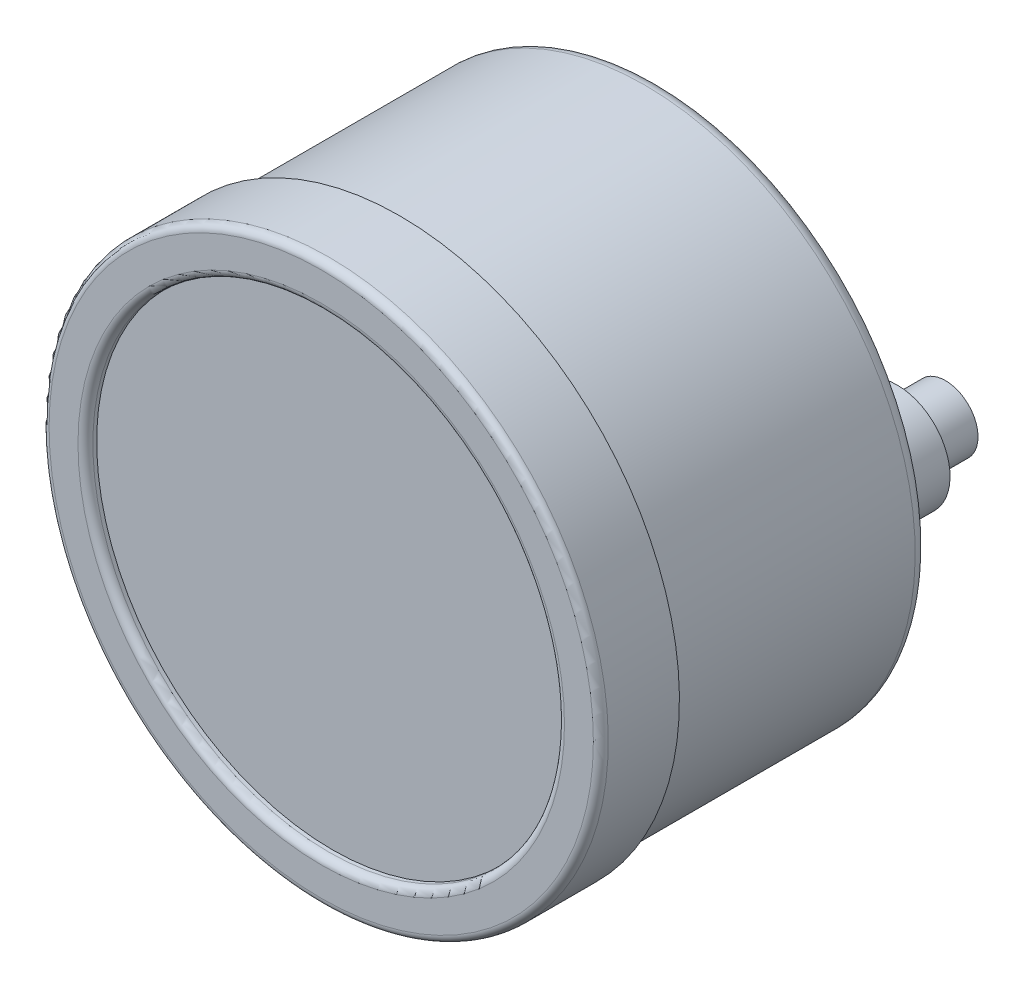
ISO-10303-21;
HEADER;
FILE_DESCRIPTION(('STEP AP214'),'2;1');
FILE_NAME('part.step','',(''),(''),'','','');
FILE_SCHEMA(('AUTOMOTIVE_DESIGN { 1 0 10303 214 1 1 1 1 }'));
ENDSEC;
DATA;
#1=APPLICATION_CONTEXT('core data for automotive mechanical design processes');
#2=APPLICATION_PROTOCOL_DEFINITION('international standard','automotive_design',2000,#1);
#3=PRODUCT_CONTEXT('',#1,'mechanical');
#4=PRODUCT('Part','Part','',(#3));
#5=PRODUCT_RELATED_PRODUCT_CATEGORY('part','',(#4));
#6=PRODUCT_DEFINITION_FORMATION('','',#4);
#7=PRODUCT_DEFINITION_CONTEXT('part definition',#1,'design');
#8=PRODUCT_DEFINITION('design','',#6,#7);
#9=PRODUCT_DEFINITION_SHAPE('','',#8);
#10=(LENGTH_UNIT() NAMED_UNIT(*) SI_UNIT(.MILLI.,.METRE.));
#11=(NAMED_UNIT(*) PLANE_ANGLE_UNIT() SI_UNIT($,.RADIAN.));
#12=(NAMED_UNIT(*) SI_UNIT($,.STERADIAN.) SOLID_ANGLE_UNIT());
#13=UNCERTAINTY_MEASURE_WITH_UNIT(LENGTH_MEASURE(1.E-05),#10,'distance_accuracy_value','');
#14=(GEOMETRIC_REPRESENTATION_CONTEXT(3) GLOBAL_UNCERTAINTY_ASSIGNED_CONTEXT((#13)) GLOBAL_UNIT_ASSIGNED_CONTEXT((#10,
#11,#12)) REPRESENTATION_CONTEXT('',''));
#15=CARTESIAN_POINT('',(0.,0.,0.));
#16=DIRECTION('',(0.,0.,1.));
#17=DIRECTION('',(1.,0.,0.));
#18=AXIS2_PLACEMENT_3D('',#15,#16,#17);
#19=CARTESIAN_POINT('',(14.055,0.,-29.3));
#20=DIRECTION('',(0.,0.,-1.));
#21=DIRECTION('',(0.,-1.,0.));
#22=AXIS2_PLACEMENT_3D('',#19,#20,#21);
#23=PLANE('',#22);
#24=CARTESIAN_POINT('',(15.,0.,-29.3));
#25=DIRECTION('',(0.,0.,1.));
#26=DIRECTION('',(0.,1.,0.));
#27=AXIS2_PLACEMENT_3D('',#24,#25,#26);
#28=CIRCLE('',#27,1.89);
#29=CARTESIAN_POINT('',(15.,1.89,-29.3));
#30=VERTEX_POINT('',#29);
#31=EDGE_CURVE('E179',#30,#30,#28,.F.);
#32=ORIENTED_EDGE('',*,*,#31,.T.);
#33=EDGE_LOOP('',(#32));
#34=FACE_BOUND('',#33,.T.);
#35=ADVANCED_FACE('F14',(#34),#23,.T.);
#36=CARTESIAN_POINT('',(15.,0.,-31.45));
#37=DIRECTION('',(0.,0.,1.));
#38=DIRECTION('',(0.,1.,0.));
#39=AXIS2_PLACEMENT_3D('',#36,#37,#38);
#40=CYLINDRICAL_SURFACE('',#39,1.89);
#41=ORIENTED_EDGE('',*,*,#31,.F.);
#42=EDGE_LOOP('',(#41));
#43=FACE_BOUND('',#42,.T.);
#44=CARTESIAN_POINT('',(15.,0.,-33.6));
#45=DIRECTION('',(0.,0.,1.));
#46=DIRECTION('',(0.,1.,0.));
#47=AXIS2_PLACEMENT_3D('',#44,#45,#46);
#48=CIRCLE('',#47,1.89);
#49=CARTESIAN_POINT('',(15.,1.89,-33.6));
#50=VERTEX_POINT('',#49);
#51=EDGE_CURVE('E176',#50,#50,#48,.T.);
#52=ORIENTED_EDGE('',*,*,#51,.F.);
#53=EDGE_LOOP('',(#52));
#54=FACE_BOUND('',#53,.T.);
#55=ADVANCED_FACE('F301',(#43,#54),#40,.F.);
#56=CARTESIAN_POINT('',(12.61,0.,-33.6));
#57=DIRECTION('',(0.,0.,-1.));
#58=DIRECTION('',(0.,-1.,0.));
#59=AXIS2_PLACEMENT_3D('',#56,#57,#58);
#60=PLANE('',#59);
#61=CARTESIAN_POINT('',(15.,0.,-33.6));
#62=DIRECTION('',(0.,0.,1.));
#63=DIRECTION('',(0.,1.,0.));
#64=AXIS2_PLACEMENT_3D('',#61,#62,#63);
#65=CIRCLE('',#64,2.89);
#66=CARTESIAN_POINT('',(15.,2.89,-33.6));
#67=VERTEX_POINT('',#66);
#68=EDGE_CURVE('E173',#67,#67,#65,.T.);
#69=ORIENTED_EDGE('',*,*,#68,.F.);
#70=EDGE_LOOP('',(#69));
#71=FACE_BOUND('',#70,.T.);
#72=ORIENTED_EDGE('',*,*,#51,.T.);
#73=EDGE_LOOP('',(#72));
#74=FACE_BOUND('',#73,.T.);
#75=ADVANCED_FACE('F281',(#71,#74),#60,.T.);
#76=CARTESIAN_POINT('',(0.,0.,6.336));
#77=DIRECTION('',(0.,0.,-1.));
#78=DIRECTION('',(0.,-1.,0.));
#79=AXIS2_PLACEMENT_3D('',#76,#77,#78);
#80=TOROIDAL_SURFACE('',#79,21.664,0.664);
#81=CARTESIAN_POINT('',(0.,0.,6.336));
#82=DIRECTION('',(0.,0.,-1.));
#83=DIRECTION('',(0.,-1.,0.));
#84=AXIS2_PLACEMENT_3D('',#81,#82,#83);
#85=CIRCLE('',#84,21.);
#86=CARTESIAN_POINT('',(0.,-21.,6.336));
#87=VERTEX_POINT('',#86);
#88=EDGE_CURVE('E182',#87,#87,#85,.T.);
#89=ORIENTED_EDGE('',*,*,#88,.T.);
#90=EDGE_LOOP('',(#89));
#91=FACE_BOUND('',#90,.T.);
#92=CARTESIAN_POINT('',(0.,0.,7.));
#93=DIRECTION('',(0.,0.,1.));
#94=DIRECTION('',(0.,1.,0.));
#95=AXIS2_PLACEMENT_3D('',#92,#93,#94);
#96=CIRCLE('',#95,21.664);
#97=CARTESIAN_POINT('',(-21.664,0.,7.));
#98=VERTEX_POINT('',#97);
#99=CARTESIAN_POINT('',(0.,21.664,7.));
#100=VERTEX_POINT('',#99);
#101=EDGE_CURVE('E64',#98,#100,#96,.F.);
#102=ORIENTED_EDGE('',*,*,#101,.F.);
#103=CARTESIAN_POINT('',(0.,0.,7.));
#104=DIRECTION('',(0.,0.,1.));
#105=DIRECTION('',(-1.,0.,0.));
#106=AXIS2_PLACEMENT_3D('',#103,#104,#105);
#107=CIRCLE('',#106,21.664);
#108=CARTESIAN_POINT('',(0.,-21.664,7.));
#109=VERTEX_POINT('',#108);
#110=EDGE_CURVE('E61',#109,#98,#107,.F.);
#111=ORIENTED_EDGE('',*,*,#110,.F.);
#112=CARTESIAN_POINT('',(0.,0.,7.));
#113=DIRECTION('',(0.,0.,1.));
#114=DIRECTION('',(0.,-1.,0.));
#115=AXIS2_PLACEMENT_3D('',#112,#113,#114);
#116=CIRCLE('',#115,21.664);
#117=EDGE_CURVE('E58',#100,#109,#116,.F.);
#118=ORIENTED_EDGE('',*,*,#117,.F.);
#119=EDGE_LOOP('',(#102,#111,#118));
#120=FACE_BOUND('',#119,.T.);
#121=ADVANCED_FACE('F63',(#91,#120),#80,.T.);
#122=CARTESIAN_POINT('',(15.,0.,-31.45));
#123=DIRECTION('',(0.,0.,1.));
#124=DIRECTION('',(0.,1.,0.));
#125=AXIS2_PLACEMENT_3D('',#122,#123,#124);
#126=CYLINDRICAL_SURFACE('',#125,2.89);
#127=ORIENTED_EDGE('',*,*,#68,.T.);
#128=EDGE_LOOP('',(#127));
#129=FACE_BOUND('',#128,.T.);
#130=CARTESIAN_POINT('',(15.,0.,-29.3));
#131=DIRECTION('',(0.,0.,1.));
#132=DIRECTION('',(0.,1.,0.));
#133=AXIS2_PLACEMENT_3D('',#130,#131,#132);
#134=CIRCLE('',#133,2.89);
#135=CARTESIAN_POINT('',(15.,2.89,-29.3));
#136=VERTEX_POINT('',#135);
#137=EDGE_CURVE('E68',#136,#136,#134,.T.);
#138=ORIENTED_EDGE('',*,*,#137,.F.);
#139=EDGE_LOOP('',(#138));
#140=FACE_BOUND('',#139,.T.);
#141=ADVANCED_FACE('F93',(#129,#140),#126,.T.);
#142=CARTESIAN_POINT('',(-22.95,0.,7.));
#143=DIRECTION('',(0.,0.,1.));
#144=DIRECTION('',(0.,1.,0.));
#145=AXIS2_PLACEMENT_3D('',#142,#143,#144);
#146=PLANE('',#145);
#147=ORIENTED_EDGE('',*,*,#117,.T.);
#148=ORIENTED_EDGE('',*,*,#110,.T.);
#149=ORIENTED_EDGE('',*,*,#101,.T.);
#150=EDGE_LOOP('',(#147,#148,#149));
#151=FACE_BOUND('',#150,.T.);
#152=CARTESIAN_POINT('',(0.,0.,7.));
#153=DIRECTION('',(0.,0.,-1.));
#154=DIRECTION('',(0.,-1.,0.));
#155=AXIS2_PLACEMENT_3D('',#152,#153,#154);
#156=CIRCLE('',#155,24.236);
#157=CARTESIAN_POINT('',(0.,-24.236,7.));
#158=VERTEX_POINT('',#157);
#159=CARTESIAN_POINT('',(-24.236,0.,7.));
#160=VERTEX_POINT('',#159);
#161=EDGE_CURVE('E122',#158,#160,#156,.T.);
#162=ORIENTED_EDGE('',*,*,#161,.F.);
#163=CARTESIAN_POINT('',(0.,0.,7.));
#164=DIRECTION('',(0.,0.,-1.));
#165=DIRECTION('',(0.,1.,0.));
#166=AXIS2_PLACEMENT_3D('',#163,#164,#165);
#167=CIRCLE('',#166,24.236);
#168=CARTESIAN_POINT('',(0.,24.236,7.));
#169=VERTEX_POINT('',#168);
#170=EDGE_CURVE('E118',#169,#158,#167,.T.);
#171=ORIENTED_EDGE('',*,*,#170,.F.);
#172=CARTESIAN_POINT('',(0.,0.,7.));
#173=DIRECTION('',(0.,0.,-1.));
#174=DIRECTION('',(-1.,0.,0.));
#175=AXIS2_PLACEMENT_3D('',#172,#173,#174);
#176=CIRCLE('',#175,24.236);
#177=EDGE_CURVE('E120',#160,#169,#176,.T.);
#178=ORIENTED_EDGE('',*,*,#177,.F.);
#179=EDGE_LOOP('',(#162,#171,#178));
#180=FACE_BOUND('',#179,.T.);
#181=ADVANCED_FACE('F72',(#151,#180),#146,.T.);
#182=CARTESIAN_POINT('',(11.205,0.,-29.3));
#183=DIRECTION('',(0.,0.,-1.));
#184=DIRECTION('',(1.,0.,0.));
#185=AXIS2_PLACEMENT_3D('',#182,#183,#184);
#186=PLANE('',#185);
#187=CARTESIAN_POINT('',(15.,0.,-29.3));
#188=DIRECTION('',(0.,0.,1.));
#189=DIRECTION('',(0.,1.,0.));
#190=AXIS2_PLACEMENT_3D('',#187,#188,#189);
#191=CIRCLE('',#190,4.7);
#192=CARTESIAN_POINT('',(15.,4.7,-29.3));
#193=VERTEX_POINT('',#192);
#194=EDGE_CURVE('E129',#193,#193,#191,.T.);
#195=ORIENTED_EDGE('',*,*,#194,.F.);
#196=EDGE_LOOP('',(#195));
#197=FACE_BOUND('',#196,.T.);
#198=ORIENTED_EDGE('',*,*,#137,.T.);
#199=EDGE_LOOP('',(#198));
#200=FACE_BOUND('',#199,.T.);
#201=ADVANCED_FACE('F92',(#197,#200),#186,.T.);
#202=CARTESIAN_POINT('',(-1.60666666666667,0.,-21.4666666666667));
#203=DIRECTION('',(0.,0.,-1.));
#204=DIRECTION('',(0.,-1.,0.));
#205=AXIS2_PLACEMENT_3D('',#202,#203,#204);
#206=PLANE('',#205);
#207=CARTESIAN_POINT('',(0.,0.,-21.4666666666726));
#208=DIRECTION('',(0.,0.,-1.));
#209=DIRECTION('',(0.,-1.,0.));
#210=AXIS2_PLACEMENT_3D('',#207,#208,#209);
#211=CIRCLE('',#210,3.21333333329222);
#212=CARTESIAN_POINT('',(0.,-3.21333333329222,-21.4666666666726));
#213=VERTEX_POINT('',#212);
#214=EDGE_CURVE('E157',#213,#213,#211,.T.);
#215=ORIENTED_EDGE('',*,*,#214,.T.);
#216=EDGE_LOOP('',(#215));
#217=FACE_BOUND('',#216,.T.);
#218=ADVANCED_FACE('F147',(#217),#206,.T.);
#219=CARTESIAN_POINT('',(0.,0.,6.336));
#220=DIRECTION('',(0.,0.,-1.));
#221=DIRECTION('',(0.,-1.,0.));
#222=AXIS2_PLACEMENT_3D('',#219,#220,#221);
#223=TOROIDAL_SURFACE('',#222,24.236,0.664);
#224=ORIENTED_EDGE('',*,*,#170,.T.);
#225=ORIENTED_EDGE('',*,*,#161,.T.);
#226=ORIENTED_EDGE('',*,*,#177,.T.);
#227=EDGE_LOOP('',(#224,#225,#226));
#228=FACE_BOUND('',#227,.T.);
#229=CARTESIAN_POINT('',(0.,0.,6.336));
#230=DIRECTION('',(0.,0.,1.));
#231=DIRECTION('',(0.,1.,0.));
#232=AXIS2_PLACEMENT_3D('',#229,#230,#231);
#233=CIRCLE('',#232,24.9);
#234=CARTESIAN_POINT('',(0.,24.9,6.336));
#235=VERTEX_POINT('',#234);
#236=EDGE_CURVE('E154',#235,#235,#233,.F.);
#237=ORIENTED_EDGE('',*,*,#236,.F.);
#238=EDGE_LOOP('',(#237));
#239=FACE_BOUND('',#238,.T.);
#240=ADVANCED_FACE('F126',(#228,#239),#223,.T.);
#241=CARTESIAN_POINT('',(15.,0.,-23.95));
#242=DIRECTION('',(0.,0.,1.));
#243=DIRECTION('',(0.,1.,0.));
#244=AXIS2_PLACEMENT_3D('',#241,#242,#243);
#245=CYLINDRICAL_SURFACE('',#244,4.7);
#246=ORIENTED_EDGE('',*,*,#194,.T.);
#247=EDGE_LOOP('',(#246));
#248=FACE_BOUND('',#247,.T.);
#249=CARTESIAN_POINT('',(15.,0.,-22.9999999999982));
#250=DIRECTION('',(0.,0.,1.));
#251=DIRECTION('',(0.,1.,0.));
#252=AXIS2_PLACEMENT_3D('',#249,#250,#251);
#253=CIRCLE('',#252,4.7);
#254=CARTESIAN_POINT('',(15.,4.7,-22.9999999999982));
#255=VERTEX_POINT('',#254);
#256=EDGE_CURVE('E156',#255,#255,#253,.T.);
#257=ORIENTED_EDGE('',*,*,#256,.F.);
#258=EDGE_LOOP('',(#257));
#259=FACE_BOUND('',#258,.T.);
#260=ADVANCED_FACE('F146',(#248,#259),#245,.T.);
#261=CARTESIAN_POINT('',(0.,0.,-23.0000000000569));
#262=DIRECTION('',(0.,0.,-1.));
#263=DIRECTION('',(0.,-1.,0.));
#264=AXIS2_PLACEMENT_3D('',#261,#262,#263);
#265=CONICAL_SURFACE('',#264,4.74666666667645,0.785398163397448);
#266=ORIENTED_EDGE('',*,*,#214,.F.);
#267=EDGE_LOOP('',(#266));
#268=FACE_BOUND('',#267,.T.);
#269=CARTESIAN_POINT('',(0.,0.,-23.0000000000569));
#270=DIRECTION('',(0.,0.,-1.));
#271=DIRECTION('',(0.,-1.,0.));
#272=AXIS2_PLACEMENT_3D('',#269,#270,#271);
#273=CIRCLE('',#272,4.74666666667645);
#274=CARTESIAN_POINT('',(0.,-4.74666666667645,-23.0000000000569));
#275=VERTEX_POINT('',#274);
#276=EDGE_CURVE('E161',#275,#275,#273,.F.);
#277=ORIENTED_EDGE('',*,*,#276,.F.);
#278=EDGE_LOOP('',(#277));
#279=FACE_BOUND('',#278,.T.);
#280=ADVANCED_FACE('F400',(#268,#279),#265,.F.);
#281=CARTESIAN_POINT('',(0.,0.,3.168));
#282=DIRECTION('',(0.,0.,1.));
#283=DIRECTION('',(0.,1.,0.));
#284=AXIS2_PLACEMENT_3D('',#281,#282,#283);
#285=CYLINDRICAL_SURFACE('',#284,24.9);
#286=CARTESIAN_POINT('',(0.,0.,0.));
#287=DIRECTION('',(0.,0.,1.));
#288=DIRECTION('',(0.,1.,0.));
#289=AXIS2_PLACEMENT_3D('',#286,#287,#288);
#290=CIRCLE('',#289,24.9);
#291=CARTESIAN_POINT('',(0.,24.9,0.));
#292=VERTEX_POINT('',#291);
#293=EDGE_CURVE('E262',#292,#292,#290,.F.);
#294=ORIENTED_EDGE('',*,*,#293,.F.);
#295=EDGE_LOOP('',(#294));
#296=FACE_BOUND('',#295,.T.);
#297=ORIENTED_EDGE('',*,*,#236,.T.);
#298=EDGE_LOOP('',(#297));
#299=FACE_BOUND('',#298,.T.);
#300=ADVANCED_FACE('F228',(#296,#299),#285,.T.);
#301=CARTESIAN_POINT('',(-13.8208333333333,0.,-23.));
#302=DIRECTION('',(0.,0.,-1.));
#303=DIRECTION('',(0.,-1.,0.));
#304=AXIS2_PLACEMENT_3D('',#301,#302,#303);
#305=PLANE('',#304);
#306=CARTESIAN_POINT('',(0.,0.,-23.));
#307=DIRECTION('',(0.,0.,1.));
#308=DIRECTION('',(0.,-1.,0.));
#309=AXIS2_PLACEMENT_3D('',#306,#307,#308);
#310=CIRCLE('',#309,22.895);
#311=CARTESIAN_POINT('',(0.,-22.895,-23.));
#312=VERTEX_POINT('',#311);
#313=CARTESIAN_POINT('',(0.,22.895,-23.));
#314=VERTEX_POINT('',#313);
#315=EDGE_CURVE('E185',#312,#314,#310,.T.);
#316=ORIENTED_EDGE('',*,*,#315,.F.);
#317=CARTESIAN_POINT('',(0.,0.,-23.));
#318=DIRECTION('',(0.,0.,1.));
#319=DIRECTION('',(-1.,0.,0.));
#320=AXIS2_PLACEMENT_3D('',#317,#318,#319);
#321=CIRCLE('',#320,22.895);
#322=CARTESIAN_POINT('',(-22.895,0.,-23.));
#323=VERTEX_POINT('',#322);
#324=EDGE_CURVE('E34',#323,#312,#321,.T.);
#325=ORIENTED_EDGE('',*,*,#324,.F.);
#326=CARTESIAN_POINT('',(0.,0.,-23.));
#327=DIRECTION('',(0.,0.,1.));
#328=DIRECTION('',(0.,1.,0.));
#329=AXIS2_PLACEMENT_3D('',#326,#327,#328);
#330=CIRCLE('',#329,22.895);
#331=EDGE_CURVE('E214',#314,#323,#330,.T.);
#332=ORIENTED_EDGE('',*,*,#331,.F.);
#333=EDGE_LOOP('',(#316,#325,#332));
#334=FACE_BOUND('',#333,.T.);
#335=ORIENTED_EDGE('',*,*,#276,.T.);
#336=EDGE_LOOP('',(#335));
#337=FACE_BOUND('',#336,.T.);
#338=ORIENTED_EDGE('',*,*,#256,.T.);
#339=EDGE_LOOP('',(#338));
#340=FACE_BOUND('',#339,.T.);
#341=ADVANCED_FACE('F219',(#334,#337,#340),#305,.T.);
#342=CARTESIAN_POINT('',(-24.5,0.,0.));
#343=DIRECTION('',(0.,0.,-1.));
#344=DIRECTION('',(0.,-1.,0.));
#345=AXIS2_PLACEMENT_3D('',#342,#343,#344);
#346=PLANE('',#345);
#347=ORIENTED_EDGE('',*,*,#293,.T.);
#348=EDGE_LOOP('',(#347));
#349=FACE_BOUND('',#348,.T.);
#350=CARTESIAN_POINT('',(0.,0.,0.));
#351=DIRECTION('',(0.,0.,1.));
#352=DIRECTION('',(0.,1.,0.));
#353=AXIS2_PLACEMENT_3D('',#350,#351,#352);
#354=CIRCLE('',#353,24.1);
#355=CARTESIAN_POINT('',(0.,24.1,0.));
#356=VERTEX_POINT('',#355);
#357=EDGE_CURVE('E25',#356,#356,#354,.F.);
#358=ORIENTED_EDGE('',*,*,#357,.F.);
#359=EDGE_LOOP('',(#358));
#360=FACE_BOUND('',#359,.T.);
#361=ADVANCED_FACE('F202',(#349,#360),#346,.T.);
#362=CARTESIAN_POINT('',(0.,0.,-21.795));
#363=DIRECTION('',(0.,0.,-1.));
#364=DIRECTION('',(0.,-1.,0.));
#365=AXIS2_PLACEMENT_3D('',#362,#363,#364);
#366=TOROIDAL_SURFACE('',#365,22.895,1.205);
#367=CARTESIAN_POINT('',(0.,0.,-21.795));
#368=DIRECTION('',(0.,0.,1.));
#369=DIRECTION('',(0.,1.,0.));
#370=AXIS2_PLACEMENT_3D('',#367,#368,#369);
#371=CIRCLE('',#370,24.1);
#372=CARTESIAN_POINT('',(0.,24.1,-21.795));
#373=VERTEX_POINT('',#372);
#374=EDGE_CURVE('E9',#373,#373,#371,.T.);
#375=ORIENTED_EDGE('',*,*,#374,.F.);
#376=EDGE_LOOP('',(#375));
#377=FACE_BOUND('',#376,.T.);
#378=ORIENTED_EDGE('',*,*,#331,.T.);
#379=ORIENTED_EDGE('',*,*,#324,.T.);
#380=ORIENTED_EDGE('',*,*,#315,.T.);
#381=EDGE_LOOP('',(#378,#379,#380));
#382=FACE_BOUND('',#381,.T.);
#383=ADVANCED_FACE('F190',(#377,#382),#366,.T.);
#384=CARTESIAN_POINT('',(0.,0.,-10.8975));
#385=DIRECTION('',(0.,0.,1.));
#386=DIRECTION('',(0.,1.,0.));
#387=AXIS2_PLACEMENT_3D('',#384,#385,#386);
#388=CYLINDRICAL_SURFACE('',#387,24.1);
#389=ORIENTED_EDGE('',*,*,#357,.T.);
#390=EDGE_LOOP('',(#389));
#391=FACE_BOUND('',#390,.T.);
#392=ORIENTED_EDGE('',*,*,#374,.T.);
#393=EDGE_LOOP('',(#392));
#394=FACE_BOUND('',#393,.T.);
#395=ADVANCED_FACE('F201',(#391,#394),#388,.T.);
#396=CARTESIAN_POINT('',(0.,0.,6.));
#397=DIRECTION('',(0.,0.,1.));
#398=DIRECTION('',(0.,1.,0.));
#399=AXIS2_PLACEMENT_3D('',#396,#397,#398);
#400=CYLINDRICAL_SURFACE('',#399,21.);
#401=CARTESIAN_POINT('',(0.,0.,6.));
#402=DIRECTION('',(0.,0.,1.));
#403=DIRECTION('',(0.,1.,0.));
#404=AXIS2_PLACEMENT_3D('',#401,#402,#403);
#405=CIRCLE('',#404,21.);
#406=CARTESIAN_POINT('',(0.,21.,6.));
#407=VERTEX_POINT('',#406);
#408=EDGE_CURVE('E465',#407,#407,#405,.T.);
#409=ORIENTED_EDGE('',*,*,#408,.F.);
#410=EDGE_LOOP('',(#409));
#411=FACE_BOUND('',#410,.T.);
#412=ORIENTED_EDGE('',*,*,#88,.F.);
#413=EDGE_LOOP('',(#412));
#414=FACE_BOUND('',#413,.T.);
#415=ADVANCED_FACE('F311',(#411,#414),#400,.F.);
#416=CARTESIAN_POINT('',(0.,0.,6.));
#417=DIRECTION('',(0.,0.,1.));
#418=DIRECTION('',(0.,1.,0.));
#419=AXIS2_PLACEMENT_3D('',#416,#417,#418);
#420=PLANE('',#419);
#421=ORIENTED_EDGE('',*,*,#408,.T.);
#422=EDGE_LOOP('',(#421));
#423=FACE_BOUND('',#422,.T.);
#424=ADVANCED_FACE('F320',(#423),#420,.T.);
#425=CLOSED_SHELL('',(#35,#55,#75,#121,#141,#181,#201,#218,#240,#260,#280,#300,#341,#361,#383,
#395,#415,#424));
#426=MANIFOLD_SOLID_BREP('B1',#425);
#427=ADVANCED_BREP_SHAPE_REPRESENTATION('',(#18,#426),#14);
#428=SHAPE_DEFINITION_REPRESENTATION(#9,#427);
ENDSEC;
END-ISO-10303-21;
